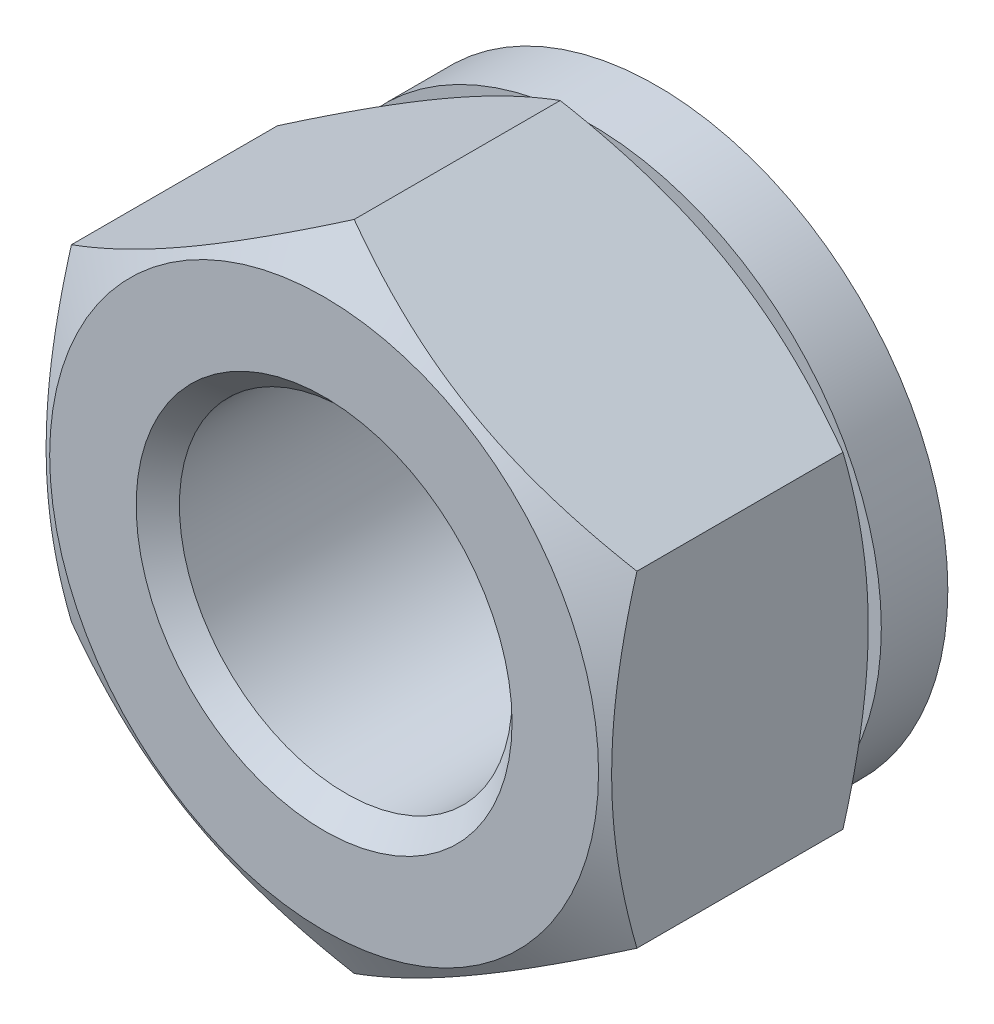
ISO-10303-21;
HEADER;
FILE_DESCRIPTION(('STEP AP214'),'2;1');
FILE_NAME('part.step','',(''),(''),'','','');
FILE_SCHEMA(('AUTOMOTIVE_DESIGN { 1 0 10303 214 1 1 1 1 }'));
ENDSEC;
DATA;
#1=APPLICATION_CONTEXT('core data for automotive mechanical design processes');
#2=APPLICATION_PROTOCOL_DEFINITION('international standard','automotive_design',2000,#1);
#3=PRODUCT_CONTEXT('',#1,'mechanical');
#4=PRODUCT('Part','Part','',(#3));
#5=PRODUCT_RELATED_PRODUCT_CATEGORY('part','',(#4));
#6=PRODUCT_DEFINITION_FORMATION('','',#4);
#7=PRODUCT_DEFINITION_CONTEXT('part definition',#1,'design');
#8=PRODUCT_DEFINITION('design','',#6,#7);
#9=PRODUCT_DEFINITION_SHAPE('','',#8);
#10=(LENGTH_UNIT() NAMED_UNIT(*) SI_UNIT(.MILLI.,.METRE.));
#11=(NAMED_UNIT(*) PLANE_ANGLE_UNIT() SI_UNIT($,.RADIAN.));
#12=(NAMED_UNIT(*) SI_UNIT($,.STERADIAN.) SOLID_ANGLE_UNIT());
#13=UNCERTAINTY_MEASURE_WITH_UNIT(LENGTH_MEASURE(1.E-05),#10,'distance_accuracy_value','');
#14=(GEOMETRIC_REPRESENTATION_CONTEXT(3) GLOBAL_UNCERTAINTY_ASSIGNED_CONTEXT((#13)) GLOBAL_UNIT_ASSIGNED_CONTEXT((#10,
#11,#12)) REPRESENTATION_CONTEXT('',''));
#15=CARTESIAN_POINT('',(0.,0.,0.));
#16=DIRECTION('',(0.,0.,1.));
#17=DIRECTION('',(1.,0.,0.));
#18=AXIS2_PLACEMENT_3D('',#15,#16,#17);
#19=CARTESIAN_POINT('',(0.,0.,2.));
#20=DIRECTION('',(0.,0.,-1.));
#21=DIRECTION('',(-1.,0.,0.));
#22=AXIS2_PLACEMENT_3D('',#19,#20,#21);
#23=CYLINDRICAL_SURFACE('',#22,8.75);
#24=CARTESIAN_POINT('',(0.,0.,2.));
#25=DIRECTION('',(0.,0.,1.));
#26=DIRECTION('',(1.,0.,0.));
#27=AXIS2_PLACEMENT_3D('',#24,#25,#26);
#28=CIRCLE('',#27,8.75);
#29=CARTESIAN_POINT('',(8.75,0.,2.));
#30=VERTEX_POINT('',#29);
#31=EDGE_CURVE('E108',#30,#30,#28,.T.);
#32=ORIENTED_EDGE('',*,*,#31,.F.);
#33=EDGE_LOOP('',(#32));
#34=FACE_BOUND('',#33,.T.);
#35=CARTESIAN_POINT('',(0.,0.,0.));
#36=DIRECTION('',(0.,0.,1.));
#37=DIRECTION('',(1.,0.,0.));
#38=AXIS2_PLACEMENT_3D('',#35,#36,#37);
#39=CIRCLE('',#38,8.75);
#40=CARTESIAN_POINT('',(8.75,0.,0.));
#41=VERTEX_POINT('',#40);
#42=EDGE_CURVE('E105',#41,#41,#39,.T.);
#43=ORIENTED_EDGE('',*,*,#42,.T.);
#44=EDGE_LOOP('',(#43));
#45=FACE_BOUND('',#44,.T.);
#46=ADVANCED_FACE('F14',(#34,#45),#23,.T.);
#47=CARTESIAN_POINT('',(0.,0.,2.));
#48=DIRECTION('',(0.,0.,1.));
#49=DIRECTION('',(1.,0.,0.));
#50=AXIS2_PLACEMENT_3D('',#47,#48,#49);
#51=PLANE('',#50);
#52=ORIENTED_EDGE('',*,*,#31,.T.);
#53=EDGE_LOOP('',(#52));
#54=FACE_BOUND('',#53,.T.);
#55=CARTESIAN_POINT('',(0.,0.,2.));
#56=DIRECTION('',(0.,0.,-1.));
#57=DIRECTION('',(-1.,0.,0.));
#58=AXIS2_PLACEMENT_3D('',#55,#56,#57);
#59=CIRCLE('',#58,8.25);
#60=CARTESIAN_POINT('',(-8.25,0.,2.));
#61=VERTEX_POINT('',#60);
#62=EDGE_CURVE('E85',#61,#61,#59,.T.);
#63=ORIENTED_EDGE('',*,*,#62,.T.);
#64=EDGE_LOOP('',(#63));
#65=FACE_BOUND('',#64,.T.);
#66=ADVANCED_FACE('F238',(#54,#65),#51,.T.);
#67=CARTESIAN_POINT('',(0.,0.,0.));
#68=DIRECTION('',(0.,0.,1.));
#69=DIRECTION('',(1.,0.,0.));
#70=AXIS2_PLACEMENT_3D('',#67,#68,#69);
#71=PLANE('',#70);
#72=CARTESIAN_POINT('',(0.,0.,0.));
#73=DIRECTION('',(0.,0.,1.));
#74=DIRECTION('',(1.,0.,0.));
#75=AXIS2_PLACEMENT_3D('',#72,#73,#74);
#76=CIRCLE('',#75,5.);
#77=CARTESIAN_POINT('',(5.,0.,0.));
#78=VERTEX_POINT('',#77);
#79=EDGE_CURVE('E93',#78,#78,#76,.T.);
#80=ORIENTED_EDGE('',*,*,#79,.T.);
#81=EDGE_LOOP('',(#80));
#82=FACE_BOUND('',#81,.T.);
#83=ORIENTED_EDGE('',*,*,#42,.F.);
#84=EDGE_LOOP('',(#83));
#85=FACE_BOUND('',#84,.T.);
#86=ADVANCED_FACE('F231',(#82,#85),#71,.F.);
#87=CARTESIAN_POINT('',(8.50003933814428,4.9075,10.));
#88=DIRECTION('',(-0.5,-0.866025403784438,0.));
#89=DIRECTION('',(0.866025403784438,-0.5,0.));
#90=AXIS2_PLACEMENT_3D('',#87,#88,#89);
#91=PLANE('',#90);
#92=DIRECTION('',(0.,0.,-1.));
#93=VECTOR('',#92,1.);
#94=CARTESIAN_POINT('',(8.50003933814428,4.9075,10.));
#95=LINE('',#94,#93);
#96=CARTESIAN_POINT('',(8.50003933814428,4.9075,9.09644682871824));
#97=VERTEX_POINT('',#96);
#98=CARTESIAN_POINT('',(8.50003933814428,4.9075,2.90355317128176));
#99=VERTEX_POINT('',#98);
#100=EDGE_CURVE('E89',#97,#99,#95,.T.);
#101=ORIENTED_EDGE('',*,*,#100,.T.);
#102=CARTESIAN_POINT('',(8.50023933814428,4.90738452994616,2.90361983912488));
#103=CARTESIAN_POINT('',(8.31339924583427,5.01525670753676,2.84134964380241));
#104=CARTESIAN_POINT('',(8.12586254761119,5.12353107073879,2.78190552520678));
#105=CARTESIAN_POINT('',(7.7492661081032,5.34095912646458,2.66944781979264));
#106=CARTESIAN_POINT('',(7.56020574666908,5.45011317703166,2.61643700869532));
#107=CARTESIAN_POINT('',(6.98999759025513,5.77932300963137,2.46809516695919));
#108=CARTESIAN_POINT('',(6.60659893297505,6.00067832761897,2.38372031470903));
#109=CARTESIAN_POINT('',(6.03285025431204,6.33193228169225,2.28478094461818));
#110=CARTESIAN_POINT('',(5.84421428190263,6.44084131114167,2.25659599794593));
#111=CARTESIAN_POINT('',(5.46608927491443,6.65915188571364,2.20933466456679));
#112=CARTESIAN_POINT('',(5.27660031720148,6.76855338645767,2.19025747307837));
#113=CARTESIAN_POINT('',(4.89729613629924,6.98754475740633,2.16169513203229));
#114=CARTESIAN_POINT('',(4.70748152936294,7.09713427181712,2.15219909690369));
#115=CARTESIAN_POINT('',(4.32767697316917,7.31641453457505,2.14300265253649));
#116=CARTESIAN_POINT('',(4.13768702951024,7.42610527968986,2.14330194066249));
#117=CARTESIAN_POINT('',(3.7824944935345,7.63117578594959,2.15301479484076));
#118=CARTESIAN_POINT('',(3.61726683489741,7.72657001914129,2.16124352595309));
#119=CARTESIAN_POINT('',(3.28719849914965,7.91713506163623,2.18494970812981));
#120=CARTESIAN_POINT('',(3.12235784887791,8.01230585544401,2.20042764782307));
#121=CARTESIAN_POINT('',(2.62847406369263,8.29744979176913,2.25736942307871));
#122=CARTESIAN_POINT('',(2.30030514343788,8.48691820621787,2.3093341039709));
#123=CARTESIAN_POINT('',(1.6404861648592,8.86786487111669,2.43924658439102));
#124=CARTESIAN_POINT('',(1.30892031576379,9.05929450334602,2.5177450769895));
#125=CARTESIAN_POINT('',(0.650733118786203,9.43929905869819,2.69590417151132));
#126=CARTESIAN_POINT('',(0.324103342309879,9.62787884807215,2.79552292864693));
#127=CARTESIAN_POINT('',(-0.000199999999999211,9.81511547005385,2.90361983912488));
#128=B_SPLINE_CURVE_WITH_KNOTS('',3,(#102,#103,#104,#105,#106,#107,#108,#109,#110,#111,#112,
#113,#114,#115,#116,#117,#118,#119,#120,#121,#122,#123,#124,#125,#126,#127),.UNSPECIFIED.,.F.,
.F.,(4,2,2,2,2,2,2,2,2,2,2,2,4),(0.,0.673599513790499,1.34748863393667,2.69806680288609,
3.35681548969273,4.01550595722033,4.67344721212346,5.33136813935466,5.90412289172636,
6.47691625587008,7.62331889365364,8.79514640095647,9.96467355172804),.UNSPECIFIED.);
#129=CARTESIAN_POINT('',(0.,9.815,2.90355317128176));
#130=VERTEX_POINT('',#129);
#131=EDGE_CURVE('E35',#99,#130,#128,.T.);
#132=ORIENTED_EDGE('',*,*,#131,.T.);
#133=DIRECTION('',(0.,0.,-1.));
#134=VECTOR('',#133,1.);
#135=CARTESIAN_POINT('',(0.,9.815,10.));
#136=LINE('',#135,#134);
#137=CARTESIAN_POINT('',(0.,9.815,9.09644682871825));
#138=VERTEX_POINT('',#137);
#139=EDGE_CURVE('E102',#138,#130,#136,.T.);
#140=ORIENTED_EDGE('',*,*,#139,.F.);
#141=CARTESIAN_POINT('',(-0.000199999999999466,9.81511547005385,9.09638016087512));
#142=CARTESIAN_POINT('',(0.186640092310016,9.70724329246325,9.15865035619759));
#143=CARTESIAN_POINT('',(0.374176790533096,9.59896892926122,9.21809447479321));
#144=CARTESIAN_POINT('',(0.750773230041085,9.38154087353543,9.33055218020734));
#145=CARTESIAN_POINT('',(0.939833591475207,9.27238682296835,9.38356299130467));
#146=CARTESIAN_POINT('',(1.51004174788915,8.94317699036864,9.5319048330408));
#147=CARTESIAN_POINT('',(1.89344040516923,8.72182167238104,9.61627968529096));
#148=CARTESIAN_POINT('',(2.46718908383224,8.39056771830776,9.7152190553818));
#149=CARTESIAN_POINT('',(2.65582505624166,8.28165868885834,9.74340400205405));
#150=CARTESIAN_POINT('',(3.03395006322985,8.06334811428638,9.7906653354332));
#151=CARTESIAN_POINT('',(3.2234390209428,7.95394661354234,9.80974252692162));
#152=CARTESIAN_POINT('',(3.60274320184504,7.73495524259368,9.8383048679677));
#153=CARTESIAN_POINT('',(3.79255780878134,7.62536572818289,9.84780090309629));
#154=CARTESIAN_POINT('',(4.17236236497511,7.40608546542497,9.8569973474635));
#155=CARTESIAN_POINT('',(4.36235230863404,7.29639472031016,9.85669805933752));
#156=CARTESIAN_POINT('',(4.71754484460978,7.09132421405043,9.84698520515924));
#157=CARTESIAN_POINT('',(4.88277250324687,6.99592998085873,9.83875647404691));
#158=CARTESIAN_POINT('',(5.21284083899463,6.80536493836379,9.81505029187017));
#159=CARTESIAN_POINT('',(5.37768148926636,6.71019414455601,9.79957235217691));
#160=CARTESIAN_POINT('',(5.87156527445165,6.42505020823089,9.74263057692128));
#161=CARTESIAN_POINT('',(6.1997341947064,6.23558179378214,9.69066589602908));
#162=CARTESIAN_POINT('',(6.85955317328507,5.85463512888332,9.56075341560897));
#163=CARTESIAN_POINT('',(7.19111902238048,5.663205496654,9.48225492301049));
#164=CARTESIAN_POINT('',(7.84930621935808,5.28320094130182,9.30409582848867));
#165=CARTESIAN_POINT('',(8.1759359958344,5.09462115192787,9.20447707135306));
#166=CARTESIAN_POINT('',(8.50023933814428,4.90738452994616,9.09638016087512));
#167=B_SPLINE_CURVE_WITH_KNOTS('',3,(#141,#142,#143,#144,#145,#146,#147,#148,#149,#150,#151,
#152,#153,#154,#155,#156,#157,#158,#159,#160,#161,#162,#163,#164,#165,#166),.UNSPECIFIED.,.F.,
.F.,(4,2,2,2,2,2,2,2,2,2,2,2,4),(0.,0.673599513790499,1.34748863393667,2.69806680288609,
3.35681548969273,4.01550595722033,4.67344721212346,5.33136813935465,5.90412289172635,
6.47691625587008,7.62331889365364,8.79514640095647,9.96467355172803),.UNSPECIFIED.);
#168=EDGE_CURVE('E130',#138,#97,#167,.T.);
#169=ORIENTED_EDGE('',*,*,#168,.T.);
#170=EDGE_LOOP('',(#101,#132,#140,#169));
#171=FACE_BOUND('',#170,.T.);
#172=ADVANCED_FACE('F147',(#171),#91,.F.);
#173=CARTESIAN_POINT('',(0.,9.815,10.));
#174=DIRECTION('',(0.5,-0.866025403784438,0.));
#175=DIRECTION('',(0.866025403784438,0.5,0.));
#176=AXIS2_PLACEMENT_3D('',#173,#174,#175);
#177=PLANE('',#176);
#178=ORIENTED_EDGE('',*,*,#139,.T.);
#179=CARTESIAN_POINT('',(0.000200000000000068,9.81511547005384,2.90361983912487));
#180=CARTESIAN_POINT('',(-0.186640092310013,9.70724329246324,2.8413496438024));
#181=CARTESIAN_POINT('',(-0.374176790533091,9.59896892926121,2.78190552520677));
#182=CARTESIAN_POINT('',(-0.750773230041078,9.38154087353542,2.66944781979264));
#183=CARTESIAN_POINT('',(-0.9398335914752,9.27238682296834,2.61643700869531));
#184=CARTESIAN_POINT('',(-1.51004174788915,8.94317699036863,2.46809516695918));
#185=CARTESIAN_POINT('',(-1.89344040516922,8.72182167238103,2.38372031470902));
#186=CARTESIAN_POINT('',(-2.46718908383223,8.39056771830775,2.28478094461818));
#187=CARTESIAN_POINT('',(-2.65582505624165,8.28165868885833,2.25659599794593));
#188=CARTESIAN_POINT('',(-3.03395006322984,8.06334811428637,2.20933466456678));
#189=CARTESIAN_POINT('',(-3.22343902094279,7.95394661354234,2.19025747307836));
#190=CARTESIAN_POINT('',(-3.60274320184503,7.73495524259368,2.16169513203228));
#191=CARTESIAN_POINT('',(-3.79255780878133,7.62536572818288,2.15219909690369));
#192=CARTESIAN_POINT('',(-4.1723623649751,7.40608546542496,2.14300265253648));
#193=CARTESIAN_POINT('',(-4.36235230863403,7.29639472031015,2.14330194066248));
#194=CARTESIAN_POINT('',(-4.71754484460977,7.09132421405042,2.15301479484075));
#195=CARTESIAN_POINT('',(-4.88277250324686,6.99592998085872,2.16124352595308));
#196=CARTESIAN_POINT('',(-5.21284083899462,6.80536493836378,2.18494970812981));
#197=CARTESIAN_POINT('',(-5.37768148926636,6.710194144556,2.20042764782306));
#198=CARTESIAN_POINT('',(-5.87156527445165,6.42505020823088,2.2573694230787));
#199=CARTESIAN_POINT('',(-6.19973419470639,6.23558179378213,2.3093341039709));
#200=CARTESIAN_POINT('',(-6.85955317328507,5.85463512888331,2.43924658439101));
#201=CARTESIAN_POINT('',(-7.19111902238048,5.66320549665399,2.51774507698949));
#202=CARTESIAN_POINT('',(-7.84930621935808,5.28320094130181,2.69590417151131));
#203=CARTESIAN_POINT('',(-8.1759359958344,5.09462115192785,2.79552292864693));
#204=CARTESIAN_POINT('',(-8.50023933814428,4.90738452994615,2.90361983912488));
#205=B_SPLINE_CURVE_WITH_KNOTS('',3,(#179,#180,#181,#182,#183,#184,#185,#186,#187,#188,#189,
#190,#191,#192,#193,#194,#195,#196,#197,#198,#199,#200,#201,#202,#203,#204),.UNSPECIFIED.,.F.,
.F.,(4,2,2,2,2,2,2,2,2,2,2,2,4),(0.,0.673599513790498,1.34748863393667,2.69806680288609,
3.35681548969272,4.01550595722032,4.67344721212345,5.33136813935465,5.90412289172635,
6.47691625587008,7.62331889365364,8.79514640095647,9.96467355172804),.UNSPECIFIED.);
#206=CARTESIAN_POINT('',(-8.50003933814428,4.9075,2.90355317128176));
#207=VERTEX_POINT('',#206);
#208=EDGE_CURVE('E204',#130,#207,#205,.T.);
#209=ORIENTED_EDGE('',*,*,#208,.T.);
#210=DIRECTION('',(0.,0.,-1.));
#211=VECTOR('',#210,1.);
#212=CARTESIAN_POINT('',(-8.50003933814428,4.9075,10.));
#213=LINE('',#212,#211);
#214=CARTESIAN_POINT('',(-8.50003933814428,4.9075,9.09644682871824));
#215=VERTEX_POINT('',#214);
#216=EDGE_CURVE('E99',#215,#207,#213,.T.);
#217=ORIENTED_EDGE('',*,*,#216,.F.);
#218=CARTESIAN_POINT('',(-8.50023933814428,4.90738452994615,9.09638016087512));
#219=CARTESIAN_POINT('',(-8.31339924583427,5.01525670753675,9.15865035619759));
#220=CARTESIAN_POINT('',(-8.12586254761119,5.12353107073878,9.21809447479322));
#221=CARTESIAN_POINT('',(-7.7492661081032,5.34095912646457,9.33055218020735));
#222=CARTESIAN_POINT('',(-7.56020574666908,5.45011317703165,9.38356299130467));
#223=CARTESIAN_POINT('',(-6.98999759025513,5.77932300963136,9.53190483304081));
#224=CARTESIAN_POINT('',(-6.60659893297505,6.00067832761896,9.61627968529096));
#225=CARTESIAN_POINT('',(-6.03285025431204,6.33193228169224,9.71521905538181));
#226=CARTESIAN_POINT('',(-5.84421428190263,6.44084131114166,9.74340400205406));
#227=CARTESIAN_POINT('',(-5.46608927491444,6.65915188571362,9.7906653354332));
#228=CARTESIAN_POINT('',(-5.27660031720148,6.76855338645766,9.80974252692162));
#229=CARTESIAN_POINT('',(-4.89729613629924,6.98754475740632,9.8383048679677));
#230=CARTESIAN_POINT('',(-4.70748152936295,7.09713427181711,9.8478009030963));
#231=CARTESIAN_POINT('',(-4.32767697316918,7.31641453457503,9.85699734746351));
#232=CARTESIAN_POINT('',(-4.13768702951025,7.42610527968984,9.85669805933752));
#233=CARTESIAN_POINT('',(-3.78249449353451,7.63117578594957,9.84698520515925));
#234=CARTESIAN_POINT('',(-3.61726683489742,7.72657001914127,9.83875647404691));
#235=CARTESIAN_POINT('',(-3.28719849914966,7.91713506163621,9.81505029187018));
#236=CARTESIAN_POINT('',(-3.12235784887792,8.01230585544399,9.79957235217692));
#237=CARTESIAN_POINT('',(-2.62847406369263,8.29744979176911,9.74263057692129));
#238=CARTESIAN_POINT('',(-2.30030514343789,8.48691820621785,9.69066589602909));
#239=CARTESIAN_POINT('',(-1.64048616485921,8.86786487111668,9.56075341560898));
#240=CARTESIAN_POINT('',(-1.3089203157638,9.059294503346,9.4822549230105));
#241=CARTESIAN_POINT('',(-0.650733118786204,9.43929905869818,9.30409582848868));
#242=CARTESIAN_POINT('',(-0.324103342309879,9.62787884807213,9.20447707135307));
#243=CARTESIAN_POINT('',(0.000199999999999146,9.81511547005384,9.09638016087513));
#244=B_SPLINE_CURVE_WITH_KNOTS('',3,(#218,#219,#220,#221,#222,#223,#224,#225,#226,#227,#228,
#229,#230,#231,#232,#233,#234,#235,#236,#237,#238,#239,#240,#241,#242,#243),.UNSPECIFIED.,.F.,
.F.,(4,2,2,2,2,2,2,2,2,2,2,2,4),(0.,0.673599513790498,1.34748863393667,2.69806680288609,
3.35681548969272,4.01550595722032,4.67344721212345,5.33136813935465,5.90412289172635,
6.47691625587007,7.62331889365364,8.79514640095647,9.96467355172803),.UNSPECIFIED.);
#245=EDGE_CURVE('E132',#215,#138,#244,.T.);
#246=ORIENTED_EDGE('',*,*,#245,.T.);
#247=EDGE_LOOP('',(#178,#209,#217,#246));
#248=FACE_BOUND('',#247,.T.);
#249=ADVANCED_FACE('F189',(#248),#177,.F.);
#250=CARTESIAN_POINT('',(-8.50003933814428,4.9075,10.));
#251=DIRECTION('',(1.,0.,0.));
#252=DIRECTION('',(0.,1.,0.));
#253=AXIS2_PLACEMENT_3D('',#250,#251,#252);
#254=PLANE('',#253);
#255=ORIENTED_EDGE('',*,*,#216,.T.);
#256=CARTESIAN_POINT('',(-8.50003933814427,-13.1271960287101,6.26596035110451));
#257=CARTESIAN_POINT('',(-8.50003933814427,-12.7564005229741,6.08631294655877));
#258=CARTESIAN_POINT('',(-8.50003933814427,-12.3847479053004,5.90840405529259));
#259=CARTESIAN_POINT('',(-8.50003933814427,-11.639272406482,5.55704220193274));
#260=CARTESIAN_POINT('',(-8.50003933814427,-11.2654491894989,5.38358995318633));
#261=CARTESIAN_POINT('',(-8.50003933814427,-10.5132239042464,5.04123586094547));
#262=CARTESIAN_POINT('',(-8.50003933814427,-10.1348079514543,4.87236441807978));
#263=CARTESIAN_POINT('',(-8.50003933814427,-9.37494700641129,4.5416061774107));
#264=CARTESIAN_POINT('',(-8.50003933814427,-8.99350215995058,4.37971904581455));
#265=CARTESIAN_POINT('',(-8.50003933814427,-8.21487833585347,4.05980450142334));
#266=CARTESIAN_POINT('',(-8.50003933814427,-7.8175825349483,3.90205983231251));
#267=CARTESIAN_POINT('',(-8.50003933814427,-7.01832355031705,3.59864278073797));
#268=CARTESIAN_POINT('',(-8.50003933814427,-6.6163598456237,3.45297176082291));
#269=CARTESIAN_POINT('',(-8.50003933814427,-5.8078909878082,3.17756695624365));
#270=CARTESIAN_POINT('',(-8.50003933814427,-5.40139711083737,3.04780042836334));
#271=CARTESIAN_POINT('',(-8.50003933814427,-4.5825936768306,2.80840297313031));
#272=CARTESIAN_POINT('',(-8.50003933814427,-4.17028601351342,2.69876564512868));
#273=CARTESIAN_POINT('',(-8.50003933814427,-3.34182963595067,2.50551172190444));
#274=CARTESIAN_POINT('',(-8.50003933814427,-2.92571425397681,2.42175611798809));
#275=CARTESIAN_POINT('',(-8.50003933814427,-2.29779625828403,2.31918745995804));
#276=CARTESIAN_POINT('',(-8.50003933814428,-2.08785026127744,2.28884062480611));
#277=CARTESIAN_POINT('',(-8.50003933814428,-1.666933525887,2.23643165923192));
#278=CARTESIAN_POINT('',(-8.50003933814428,-1.45596288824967,2.21436873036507));
#279=CARTESIAN_POINT('',(-8.50003933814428,-1.03601130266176,2.17924099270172));
#280=CARTESIAN_POINT('',(-8.50003933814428,-0.827039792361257,2.16606378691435));
#281=CARTESIAN_POINT('',(-8.50003933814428,-0.408727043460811,2.14855433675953));
#282=CARTESIAN_POINT('',(-8.50003933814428,-0.199385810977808,2.14422194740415));
#283=CARTESIAN_POINT('',(-8.50003933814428,0.219292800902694,2.14450534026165));
#284=CARTESIAN_POINT('',(-8.50003933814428,0.428630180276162,2.14912116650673));
#285=CARTESIAN_POINT('',(-8.50003933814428,0.846925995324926,2.16718913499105));
#286=CARTESIAN_POINT('',(-8.50003933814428,1.05588441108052,2.18064172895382));
#287=CARTESIAN_POINT('',(-8.50003933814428,1.55975494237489,2.22345224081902));
#288=CARTESIAN_POINT('',(-8.50003933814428,1.85431041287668,2.25709613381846));
#289=CARTESIAN_POINT('',(-8.50003933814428,2.44118501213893,2.34009477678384));
#290=CARTESIAN_POINT('',(-8.50003933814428,2.73350382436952,2.38945170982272));
#291=CARTESIAN_POINT('',(-8.50003933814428,3.60679938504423,2.55847056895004));
#292=CARTESIAN_POINT('',(-8.50003933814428,4.18377882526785,2.69904823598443));
#293=CARTESIAN_POINT('',(-8.50003933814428,5.04644135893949,2.94219009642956));
#294=CARTESIAN_POINT('',(-8.50003933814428,5.33661493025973,3.02973307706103));
#295=CARTESIAN_POINT('',(-8.50003933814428,5.91414265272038,3.21375413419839));
#296=CARTESIAN_POINT('',(-8.50003933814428,6.20149678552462,3.31023226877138));
#297=CARTESIAN_POINT('',(-8.50003933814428,6.77347904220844,3.51058879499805));
#298=CARTESIAN_POINT('',(-8.50003933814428,7.05810806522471,3.61446464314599));
#299=CARTESIAN_POINT('',(-8.50003933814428,7.62501855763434,3.82841012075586));
#300=CARTESIAN_POINT('',(-8.50003933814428,7.90730005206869,3.93847968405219));
#301=CARTESIAN_POINT('',(-8.50003933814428,8.56328889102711,4.20123752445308));
#302=CARTESIAN_POINT('',(-8.50003933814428,8.93619219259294,4.35592918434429));
#303=CARTESIAN_POINT('',(-8.50003933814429,9.67891328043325,4.67257096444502));
#304=CARTESIAN_POINT('',(-8.50003933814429,10.0487308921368,4.83452149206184));
#305=CARTESIAN_POINT('',(-8.50003933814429,10.7858420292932,5.16425519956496));
#306=CARTESIAN_POINT('',(-8.50003933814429,11.1531350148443,5.33203958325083));
#307=CARTESIAN_POINT('',(-8.50003933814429,11.8855331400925,5.67228799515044));
#308=CARTESIAN_POINT('',(-8.50003933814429,12.2506383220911,5.84475193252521));
#309=CARTESIAN_POINT('',(-8.50003933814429,12.9793935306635,6.1936792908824));
#310=CARTESIAN_POINT('',(-8.50003933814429,13.3430416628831,6.37014666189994));
#311=CARTESIAN_POINT('',(-8.50003933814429,14.0687892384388,6.72624062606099));
#312=CARTESIAN_POINT('',(-8.50003933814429,14.430888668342,6.90586724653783));
#313=CARTESIAN_POINT('',(-8.50003933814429,15.5151373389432,7.44861552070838));
#314=CARTESIAN_POINT('',(-8.50003933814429,16.2353279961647,7.81564952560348));
#315=CARTESIAN_POINT('',(-8.50003933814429,17.6133335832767,8.5268751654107));
#316=CARTESIAN_POINT('',(-8.50003933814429,18.271447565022,8.87048992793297));
#317=CARTESIAN_POINT('',(-8.50003933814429,19.5852195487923,9.562431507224));
#318=CARTESIAN_POINT('',(-8.50003933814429,20.2408774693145,9.91075847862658));
#319=CARTESIAN_POINT('',(-8.50003933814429,21.5487128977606,10.6101790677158));
#320=CARTESIAN_POINT('',(-8.5000393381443,22.2008949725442,10.9612641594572));
#321=CARTESIAN_POINT('',(-8.5000393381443,23.5036827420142,11.6662666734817));
#322=CARTESIAN_POINT('',(-8.5000393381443,24.154288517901,12.0201839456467));
#323=CARTESIAN_POINT('',(-8.5000393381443,24.8043111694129,12.3751618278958));
#324=B_SPLINE_CURVE_WITH_KNOTS('',3,(#256,#257,#258,#259,#260,#261,#262,#263,#264,#265,#266,
#267,#268,#269,#270,#271,#272,#273,#274,#275,#276,#277,#278,#279,#280,#281,#282,#283,#284,#285,
#286,#287,#288,#289,#290,#291,#292,#293,#294,#295,#296,#297,#298,#299,#300,#301,#302,#303,#304,
#305,#306,#307,#308,#309,#310,#311,#312,#313,#314,#315,#316,#317,#318,#319,#320,#321,#322,#323),
.UNSPECIFIED.,.F.,.F.,(4,2,2,2,2,2,2,2,2,2,2,2,2,2,2,2,2,2,2,2,2,2,2,2,2,2,2,2,2,2,2,2,2,4),(0.,
1.23608270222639,2.47236203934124,3.71546510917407,4.95850870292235,6.24075501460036,
7.52314583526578,8.80285054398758,10.0821476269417,11.35444923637,11.990695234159,
12.6268798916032,13.2548583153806,13.8828264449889,14.5107976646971,15.1388009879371,
16.0277094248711,16.9167414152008,18.6958148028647,19.6050155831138,20.5142222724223,
21.4231178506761,22.3320037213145,23.5430484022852,24.7541611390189,25.9655252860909,
27.1768659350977,28.3894587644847,29.6020620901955,32.0269655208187,34.2542003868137,
36.4815085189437,38.7035316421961,40.9254377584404),.UNSPECIFIED.);
#325=CARTESIAN_POINT('',(-8.50003933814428,-4.9075,2.90355317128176));
#326=VERTEX_POINT('',#325);
#327=EDGE_CURVE('E196',#207,#326,#324,.F.);
#328=ORIENTED_EDGE('',*,*,#327,.T.);
#329=DIRECTION('',(0.,0.,-1.));
#330=VECTOR('',#329,1.);
#331=CARTESIAN_POINT('',(-8.50003933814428,-4.9075,10.));
#332=LINE('',#331,#330);
#333=CARTESIAN_POINT('',(-8.50003933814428,-4.9075,9.09644682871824));
#334=VERTEX_POINT('',#333);
#335=EDGE_CURVE('E91',#334,#326,#332,.T.);
#336=ORIENTED_EDGE('',*,*,#335,.F.);
#337=CARTESIAN_POINT('',(-8.50003933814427,-13.1271960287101,5.73403964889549));
#338=CARTESIAN_POINT('',(-8.50003933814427,-12.7564005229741,5.91368705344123));
#339=CARTESIAN_POINT('',(-8.50003933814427,-12.3847479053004,6.0915959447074));
#340=CARTESIAN_POINT('',(-8.50003933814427,-11.639272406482,6.44295779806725));
#341=CARTESIAN_POINT('',(-8.50003933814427,-11.2654491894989,6.61641004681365));
#342=CARTESIAN_POINT('',(-8.50003933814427,-10.5132239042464,6.95876413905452));
#343=CARTESIAN_POINT('',(-8.50003933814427,-10.1348079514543,7.12763558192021));
#344=CARTESIAN_POINT('',(-8.50003933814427,-9.37494700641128,7.45839382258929));
#345=CARTESIAN_POINT('',(-8.50003933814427,-8.99350215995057,7.62028095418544));
#346=CARTESIAN_POINT('',(-8.50003933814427,-8.21487833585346,7.94019549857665));
#347=CARTESIAN_POINT('',(-8.50003933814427,-7.8175825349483,8.09794016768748));
#348=CARTESIAN_POINT('',(-8.50003933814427,-7.01832355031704,8.40135721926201));
#349=CARTESIAN_POINT('',(-8.50003933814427,-6.61635984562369,8.54702823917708));
#350=CARTESIAN_POINT('',(-8.50003933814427,-5.8078909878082,8.82243304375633));
#351=CARTESIAN_POINT('',(-8.50003933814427,-5.40139711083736,8.95219957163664));
#352=CARTESIAN_POINT('',(-8.50003933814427,-4.58259367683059,9.19159702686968));
#353=CARTESIAN_POINT('',(-8.50003933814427,-4.17028601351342,9.30123435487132));
#354=CARTESIAN_POINT('',(-8.50003933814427,-3.34182963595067,9.49448827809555));
#355=CARTESIAN_POINT('',(-8.50003933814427,-2.92571425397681,9.57824388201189));
#356=CARTESIAN_POINT('',(-8.50003933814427,-2.29779625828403,9.68081254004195));
#357=CARTESIAN_POINT('',(-8.50003933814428,-2.08785026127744,9.71115937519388));
#358=CARTESIAN_POINT('',(-8.50003933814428,-1.666933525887,9.76356834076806));
#359=CARTESIAN_POINT('',(-8.50003933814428,-1.45596288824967,9.78563126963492));
#360=CARTESIAN_POINT('',(-8.50003933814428,-1.03601130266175,9.82075900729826));
#361=CARTESIAN_POINT('',(-8.50003933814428,-0.827039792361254,9.83393621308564));
#362=CARTESIAN_POINT('',(-8.50003933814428,-0.408727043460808,9.85144566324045));
#363=CARTESIAN_POINT('',(-8.50003933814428,-0.199385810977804,9.85577805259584));
#364=CARTESIAN_POINT('',(-8.50003933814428,0.219292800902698,9.85549465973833));
#365=CARTESIAN_POINT('',(-8.50003933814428,0.428630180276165,9.85087883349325));
#366=CARTESIAN_POINT('',(-8.50003933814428,0.84692599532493,9.83281086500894));
#367=CARTESIAN_POINT('',(-8.50003933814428,1.05588441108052,9.81935827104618));
#368=CARTESIAN_POINT('',(-8.50003933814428,1.5597549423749,9.77654775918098));
#369=CARTESIAN_POINT('',(-8.50003933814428,1.85431041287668,9.74290386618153));
#370=CARTESIAN_POINT('',(-8.50003933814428,2.44118501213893,9.65990522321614));
#371=CARTESIAN_POINT('',(-8.50003933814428,2.73350382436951,9.61054829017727));
#372=CARTESIAN_POINT('',(-8.50003933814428,3.60679938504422,9.44152943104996));
#373=CARTESIAN_POINT('',(-8.50003933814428,4.18377882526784,9.30095176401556));
#374=CARTESIAN_POINT('',(-8.50003933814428,5.04644135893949,9.05780990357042));
#375=CARTESIAN_POINT('',(-8.50003933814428,5.33661493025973,8.97026692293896));
#376=CARTESIAN_POINT('',(-8.50003933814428,5.91414265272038,8.7862458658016));
#377=CARTESIAN_POINT('',(-8.50003933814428,6.20149678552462,8.6897677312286));
#378=CARTESIAN_POINT('',(-8.50003933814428,6.77347904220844,8.48941120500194));
#379=CARTESIAN_POINT('',(-8.50003933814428,7.0581080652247,8.38553535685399));
#380=CARTESIAN_POINT('',(-8.50003933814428,7.62501855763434,8.17158987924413));
#381=CARTESIAN_POINT('',(-8.50003933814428,7.90730005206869,8.06152031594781));
#382=CARTESIAN_POINT('',(-8.50003933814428,8.5632888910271,7.79876247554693));
#383=CARTESIAN_POINT('',(-8.50003933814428,8.93619219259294,7.6440708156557));
#384=CARTESIAN_POINT('',(-8.50003933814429,9.67891328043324,7.32742903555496));
#385=CARTESIAN_POINT('',(-8.50003933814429,10.0487308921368,7.16547850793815));
#386=CARTESIAN_POINT('',(-8.50003933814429,10.7858420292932,6.83574480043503));
#387=CARTESIAN_POINT('',(-8.50003933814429,11.1531350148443,6.66796041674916));
#388=CARTESIAN_POINT('',(-8.50003933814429,11.8855331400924,6.32771200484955));
#389=CARTESIAN_POINT('',(-8.50003933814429,12.2506383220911,6.15524806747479));
#390=CARTESIAN_POINT('',(-8.50003933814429,12.9793935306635,5.8063207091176));
#391=CARTESIAN_POINT('',(-8.50003933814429,13.3430416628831,5.62985333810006));
#392=CARTESIAN_POINT('',(-8.50003933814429,14.0687892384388,5.27375937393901));
#393=CARTESIAN_POINT('',(-8.50003933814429,14.430888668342,5.09413275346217));
#394=CARTESIAN_POINT('',(-8.50003933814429,15.5151373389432,4.55138447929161));
#395=CARTESIAN_POINT('',(-8.50003933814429,16.2353279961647,4.18435047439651));
#396=CARTESIAN_POINT('',(-8.50003933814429,17.6133335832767,3.4731248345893));
#397=CARTESIAN_POINT('',(-8.50003933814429,18.271447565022,3.12951007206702));
#398=CARTESIAN_POINT('',(-8.50003933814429,19.5852195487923,2.43756849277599));
#399=CARTESIAN_POINT('',(-8.50003933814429,20.2408774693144,2.08924152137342));
#400=CARTESIAN_POINT('',(-8.50003933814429,21.5487128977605,1.38982093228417));
#401=CARTESIAN_POINT('',(-8.5000393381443,22.2008949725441,1.03873584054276));
#402=CARTESIAN_POINT('',(-8.5000393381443,23.5036827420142,0.33373332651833));
#403=CARTESIAN_POINT('',(-8.5000393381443,24.154288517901,-0.0201839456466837));
#404=CARTESIAN_POINT('',(-8.5000393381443,24.8043111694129,-0.37516182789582));
#405=B_SPLINE_CURVE_WITH_KNOTS('',3,(#337,#338,#339,#340,#341,#342,#343,#344,#345,#346,#347,
#348,#349,#350,#351,#352,#353,#354,#355,#356,#357,#358,#359,#360,#361,#362,#363,#364,#365,#366,
#367,#368,#369,#370,#371,#372,#373,#374,#375,#376,#377,#378,#379,#380,#381,#382,#383,#384,#385,
#386,#387,#388,#389,#390,#391,#392,#393,#394,#395,#396,#397,#398,#399,#400,#401,#402,#403,#404),
.UNSPECIFIED.,.F.,.F.,(4,2,2,2,2,2,2,2,2,2,2,2,2,2,2,2,2,2,2,2,2,2,2,2,2,2,2,2,2,2,2,2,2,4),(0.,
1.23608270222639,2.47236203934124,3.71546510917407,4.95850870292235,6.24075501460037,
7.52314583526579,8.80285054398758,10.0821476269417,11.35444923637,11.990695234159,
12.6268798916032,13.2548583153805,13.8828264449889,14.5107976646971,15.1388009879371,
16.0277094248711,16.9167414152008,18.6958148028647,19.6050155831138,20.5142222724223,
21.423117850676,22.3320037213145,23.5430484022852,24.7541611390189,25.9655252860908,
27.1768659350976,28.3894587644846,29.6020620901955,32.0269655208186,34.2542003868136,
36.4815085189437,38.7035316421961,40.9254377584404),.UNSPECIFIED.);
#406=EDGE_CURVE('E178',#334,#215,#405,.T.);
#407=ORIENTED_EDGE('',*,*,#406,.T.);
#408=EDGE_LOOP('',(#255,#328,#336,#407));
#409=FACE_BOUND('',#408,.T.);
#410=ADVANCED_FACE('F185',(#409),#254,.F.);
#411=CARTESIAN_POINT('',(-8.50003933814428,-4.9075,10.));
#412=DIRECTION('',(0.5,0.866025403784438,0.));
#413=DIRECTION('',(-0.866025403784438,0.5,0.));
#414=AXIS2_PLACEMENT_3D('',#411,#412,#413);
#415=PLANE('',#414);
#416=ORIENTED_EDGE('',*,*,#335,.T.);
#417=CARTESIAN_POINT('',(-8.50023933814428,-4.90738452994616,2.90361983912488));
#418=CARTESIAN_POINT('',(-8.31339924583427,-5.01525670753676,2.84134964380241));
#419=CARTESIAN_POINT('',(-8.12586254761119,-5.12353107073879,2.78190552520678));
#420=CARTESIAN_POINT('',(-7.7492661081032,-5.34095912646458,2.66944781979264));
#421=CARTESIAN_POINT('',(-7.56020574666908,-5.45011317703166,2.61643700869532));
#422=CARTESIAN_POINT('',(-6.98999759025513,-5.77932300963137,2.46809516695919));
#423=CARTESIAN_POINT('',(-6.60659893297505,-6.00067832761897,2.38372031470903));
#424=CARTESIAN_POINT('',(-6.03285025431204,-6.33193228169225,2.28478094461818));
#425=CARTESIAN_POINT('',(-5.84421428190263,-6.44084131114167,2.25659599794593));
#426=CARTESIAN_POINT('',(-5.46608927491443,-6.65915188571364,2.20933466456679));
#427=CARTESIAN_POINT('',(-5.27660031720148,-6.76855338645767,2.19025747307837));
#428=CARTESIAN_POINT('',(-4.89729613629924,-6.98754475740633,2.16169513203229));
#429=CARTESIAN_POINT('',(-4.70748152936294,-7.09713427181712,2.15219909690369));
#430=CARTESIAN_POINT('',(-4.32767697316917,-7.31641453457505,2.14300265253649));
#431=CARTESIAN_POINT('',(-4.13768702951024,-7.42610527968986,2.14330194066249));
#432=CARTESIAN_POINT('',(-3.7824944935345,-7.63117578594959,2.15301479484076));
#433=CARTESIAN_POINT('',(-3.61726683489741,-7.72657001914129,2.16124352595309));
#434=CARTESIAN_POINT('',(-3.28719849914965,-7.91713506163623,2.18494970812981));
#435=CARTESIAN_POINT('',(-3.12235784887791,-8.01230585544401,2.20042764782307));
#436=CARTESIAN_POINT('',(-2.62847406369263,-8.29744979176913,2.25736942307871));
#437=CARTESIAN_POINT('',(-2.30030514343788,-8.48691820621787,2.3093341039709));
#438=CARTESIAN_POINT('',(-1.6404861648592,-8.86786487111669,2.43924658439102));
#439=CARTESIAN_POINT('',(-1.30892031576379,-9.05929450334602,2.5177450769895));
#440=CARTESIAN_POINT('',(-0.650733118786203,-9.43929905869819,2.69590417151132));
#441=CARTESIAN_POINT('',(-0.324103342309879,-9.62787884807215,2.79552292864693));
#442=CARTESIAN_POINT('',(0.000199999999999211,-9.81511547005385,2.90361983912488));
#443=B_SPLINE_CURVE_WITH_KNOTS('',3,(#417,#418,#419,#420,#421,#422,#423,#424,#425,#426,#427,
#428,#429,#430,#431,#432,#433,#434,#435,#436,#437,#438,#439,#440,#441,#442),.UNSPECIFIED.,.F.,
.F.,(4,2,2,2,2,2,2,2,2,2,2,2,4),(0.,0.673599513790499,1.34748863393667,2.69806680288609,
3.35681548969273,4.01550595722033,4.67344721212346,5.33136813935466,5.90412289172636,
6.47691625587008,7.62331889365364,8.79514640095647,9.96467355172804),.UNSPECIFIED.);
#444=CARTESIAN_POINT('',(0.,-9.815,2.90355317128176));
#445=VERTEX_POINT('',#444);
#446=EDGE_CURVE('E84',#326,#445,#443,.T.);
#447=ORIENTED_EDGE('',*,*,#446,.T.);
#448=DIRECTION('',(0.,0.,-1.));
#449=VECTOR('',#448,1.);
#450=CARTESIAN_POINT('',(0.,-9.815,10.));
#451=LINE('',#450,#449);
#452=CARTESIAN_POINT('',(0.,-9.815,9.09644682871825));
#453=VERTEX_POINT('',#452);
#454=EDGE_CURVE('E83',#453,#445,#451,.T.);
#455=ORIENTED_EDGE('',*,*,#454,.F.);
#456=CARTESIAN_POINT('',(0.000199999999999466,-9.81511547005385,9.09638016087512));
#457=CARTESIAN_POINT('',(-0.186640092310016,-9.70724329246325,9.15865035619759));
#458=CARTESIAN_POINT('',(-0.374176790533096,-9.59896892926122,9.21809447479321));
#459=CARTESIAN_POINT('',(-0.750773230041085,-9.38154087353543,9.33055218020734));
#460=CARTESIAN_POINT('',(-0.939833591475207,-9.27238682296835,9.38356299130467));
#461=CARTESIAN_POINT('',(-1.51004174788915,-8.94317699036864,9.5319048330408));
#462=CARTESIAN_POINT('',(-1.89344040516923,-8.72182167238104,9.61627968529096));
#463=CARTESIAN_POINT('',(-2.46718908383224,-8.39056771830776,9.7152190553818));
#464=CARTESIAN_POINT('',(-2.65582505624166,-8.28165868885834,9.74340400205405));
#465=CARTESIAN_POINT('',(-3.03395006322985,-8.06334811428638,9.7906653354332));
#466=CARTESIAN_POINT('',(-3.2234390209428,-7.95394661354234,9.80974252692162));
#467=CARTESIAN_POINT('',(-3.60274320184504,-7.73495524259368,9.8383048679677));
#468=CARTESIAN_POINT('',(-3.79255780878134,-7.62536572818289,9.84780090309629));
#469=CARTESIAN_POINT('',(-4.17236236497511,-7.40608546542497,9.8569973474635));
#470=CARTESIAN_POINT('',(-4.36235230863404,-7.29639472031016,9.85669805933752));
#471=CARTESIAN_POINT('',(-4.71754484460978,-7.09132421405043,9.84698520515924));
#472=CARTESIAN_POINT('',(-4.88277250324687,-6.99592998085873,9.83875647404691));
#473=CARTESIAN_POINT('',(-5.21284083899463,-6.80536493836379,9.81505029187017));
#474=CARTESIAN_POINT('',(-5.37768148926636,-6.71019414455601,9.79957235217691));
#475=CARTESIAN_POINT('',(-5.87156527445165,-6.42505020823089,9.74263057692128));
#476=CARTESIAN_POINT('',(-6.1997341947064,-6.23558179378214,9.69066589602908));
#477=CARTESIAN_POINT('',(-6.85955317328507,-5.85463512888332,9.56075341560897));
#478=CARTESIAN_POINT('',(-7.19111902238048,-5.663205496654,9.48225492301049));
#479=CARTESIAN_POINT('',(-7.84930621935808,-5.28320094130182,9.30409582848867));
#480=CARTESIAN_POINT('',(-8.1759359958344,-5.09462115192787,9.20447707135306));
#481=CARTESIAN_POINT('',(-8.50023933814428,-4.90738452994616,9.09638016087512));
#482=B_SPLINE_CURVE_WITH_KNOTS('',3,(#456,#457,#458,#459,#460,#461,#462,#463,#464,#465,#466,
#467,#468,#469,#470,#471,#472,#473,#474,#475,#476,#477,#478,#479,#480,#481),.UNSPECIFIED.,.F.,
.F.,(4,2,2,2,2,2,2,2,2,2,2,2,4),(0.,0.673599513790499,1.34748863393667,2.69806680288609,
3.35681548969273,4.01550595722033,4.67344721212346,5.33136813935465,5.90412289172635,
6.47691625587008,7.62331889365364,8.79514640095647,9.96467355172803),.UNSPECIFIED.);
#483=EDGE_CURVE('E172',#453,#334,#482,.T.);
#484=ORIENTED_EDGE('',*,*,#483,.T.);
#485=EDGE_LOOP('',(#416,#447,#455,#484));
#486=FACE_BOUND('',#485,.T.);
#487=ADVANCED_FACE('F188',(#486),#415,.F.);
#488=CARTESIAN_POINT('',(0.,-9.815,10.));
#489=DIRECTION('',(-0.5,0.866025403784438,0.));
#490=DIRECTION('',(-0.866025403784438,-0.5,0.));
#491=AXIS2_PLACEMENT_3D('',#488,#489,#490);
#492=PLANE('',#491);
#493=ORIENTED_EDGE('',*,*,#454,.T.);
#494=CARTESIAN_POINT('',(-0.000200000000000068,-9.81511547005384,2.90361983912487));
#495=CARTESIAN_POINT('',(0.186640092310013,-9.70724329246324,2.8413496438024));
#496=CARTESIAN_POINT('',(0.374176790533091,-9.59896892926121,2.78190552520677));
#497=CARTESIAN_POINT('',(0.750773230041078,-9.38154087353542,2.66944781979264));
#498=CARTESIAN_POINT('',(0.9398335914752,-9.27238682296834,2.61643700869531));
#499=CARTESIAN_POINT('',(1.51004174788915,-8.94317699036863,2.46809516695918));
#500=CARTESIAN_POINT('',(1.89344040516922,-8.72182167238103,2.38372031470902));
#501=CARTESIAN_POINT('',(2.46718908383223,-8.39056771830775,2.28478094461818));
#502=CARTESIAN_POINT('',(2.65582505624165,-8.28165868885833,2.25659599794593));
#503=CARTESIAN_POINT('',(3.03395006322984,-8.06334811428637,2.20933466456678));
#504=CARTESIAN_POINT('',(3.22343902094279,-7.95394661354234,2.19025747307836));
#505=CARTESIAN_POINT('',(3.60274320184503,-7.73495524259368,2.16169513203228));
#506=CARTESIAN_POINT('',(3.79255780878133,-7.62536572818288,2.15219909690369));
#507=CARTESIAN_POINT('',(4.1723623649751,-7.40608546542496,2.14300265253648));
#508=CARTESIAN_POINT('',(4.36235230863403,-7.29639472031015,2.14330194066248));
#509=CARTESIAN_POINT('',(4.71754484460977,-7.09132421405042,2.15301479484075));
#510=CARTESIAN_POINT('',(4.88277250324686,-6.99592998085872,2.16124352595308));
#511=CARTESIAN_POINT('',(5.21284083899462,-6.80536493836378,2.18494970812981));
#512=CARTESIAN_POINT('',(5.37768148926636,-6.710194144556,2.20042764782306));
#513=CARTESIAN_POINT('',(5.87156527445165,-6.42505020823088,2.2573694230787));
#514=CARTESIAN_POINT('',(6.19973419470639,-6.23558179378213,2.3093341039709));
#515=CARTESIAN_POINT('',(6.85955317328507,-5.85463512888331,2.43924658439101));
#516=CARTESIAN_POINT('',(7.19111902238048,-5.66320549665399,2.51774507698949));
#517=CARTESIAN_POINT('',(7.84930621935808,-5.28320094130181,2.69590417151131));
#518=CARTESIAN_POINT('',(8.1759359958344,-5.09462115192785,2.79552292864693));
#519=CARTESIAN_POINT('',(8.50023933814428,-4.90738452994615,2.90361983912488));
#520=B_SPLINE_CURVE_WITH_KNOTS('',3,(#494,#495,#496,#497,#498,#499,#500,#501,#502,#503,#504,
#505,#506,#507,#508,#509,#510,#511,#512,#513,#514,#515,#516,#517,#518,#519),.UNSPECIFIED.,.F.,
.F.,(4,2,2,2,2,2,2,2,2,2,2,2,4),(0.,0.673599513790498,1.34748863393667,2.69806680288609,
3.35681548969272,4.01550595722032,4.67344721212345,5.33136813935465,5.90412289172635,
6.47691625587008,7.62331889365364,8.79514640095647,9.96467355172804),.UNSPECIFIED.);
#521=CARTESIAN_POINT('',(8.50003933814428,-4.9075,2.90355317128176));
#522=VERTEX_POINT('',#521);
#523=EDGE_CURVE('E71',#445,#522,#520,.T.);
#524=ORIENTED_EDGE('',*,*,#523,.T.);
#525=DIRECTION('',(0.,0.,-1.));
#526=VECTOR('',#525,1.);
#527=CARTESIAN_POINT('',(8.50003933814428,-4.9075,10.));
#528=LINE('',#527,#526);
#529=CARTESIAN_POINT('',(8.50003933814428,-4.9075,9.09644682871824));
#530=VERTEX_POINT('',#529);
#531=EDGE_CURVE('E81',#530,#522,#528,.T.);
#532=ORIENTED_EDGE('',*,*,#531,.F.);
#533=CARTESIAN_POINT('',(8.50023933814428,-4.90738452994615,9.09638016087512));
#534=CARTESIAN_POINT('',(8.31339924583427,-5.01525670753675,9.15865035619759));
#535=CARTESIAN_POINT('',(8.12586254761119,-5.12353107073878,9.21809447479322));
#536=CARTESIAN_POINT('',(7.7492661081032,-5.34095912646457,9.33055218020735));
#537=CARTESIAN_POINT('',(7.56020574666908,-5.45011317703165,9.38356299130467));
#538=CARTESIAN_POINT('',(6.98999759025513,-5.77932300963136,9.53190483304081));
#539=CARTESIAN_POINT('',(6.60659893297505,-6.00067832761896,9.61627968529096));
#540=CARTESIAN_POINT('',(6.03285025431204,-6.33193228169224,9.71521905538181));
#541=CARTESIAN_POINT('',(5.84421428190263,-6.44084131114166,9.74340400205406));
#542=CARTESIAN_POINT('',(5.46608927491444,-6.65915188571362,9.7906653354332));
#543=CARTESIAN_POINT('',(5.27660031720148,-6.76855338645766,9.80974252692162));
#544=CARTESIAN_POINT('',(4.89729613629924,-6.98754475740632,9.8383048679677));
#545=CARTESIAN_POINT('',(4.70748152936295,-7.09713427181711,9.8478009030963));
#546=CARTESIAN_POINT('',(4.32767697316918,-7.31641453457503,9.85699734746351));
#547=CARTESIAN_POINT('',(4.13768702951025,-7.42610527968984,9.85669805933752));
#548=CARTESIAN_POINT('',(3.78249449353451,-7.63117578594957,9.84698520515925));
#549=CARTESIAN_POINT('',(3.61726683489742,-7.72657001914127,9.83875647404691));
#550=CARTESIAN_POINT('',(3.28719849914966,-7.91713506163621,9.81505029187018));
#551=CARTESIAN_POINT('',(3.12235784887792,-8.01230585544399,9.79957235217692));
#552=CARTESIAN_POINT('',(2.62847406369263,-8.29744979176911,9.74263057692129));
#553=CARTESIAN_POINT('',(2.30030514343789,-8.48691820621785,9.69066589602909));
#554=CARTESIAN_POINT('',(1.64048616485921,-8.86786487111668,9.56075341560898));
#555=CARTESIAN_POINT('',(1.3089203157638,-9.059294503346,9.4822549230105));
#556=CARTESIAN_POINT('',(0.650733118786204,-9.43929905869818,9.30409582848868));
#557=CARTESIAN_POINT('',(0.324103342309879,-9.62787884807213,9.20447707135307));
#558=CARTESIAN_POINT('',(-0.000199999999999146,-9.81511547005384,9.09638016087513));
#559=B_SPLINE_CURVE_WITH_KNOTS('',3,(#533,#534,#535,#536,#537,#538,#539,#540,#541,#542,#543,
#544,#545,#546,#547,#548,#549,#550,#551,#552,#553,#554,#555,#556,#557,#558),.UNSPECIFIED.,.F.,
.F.,(4,2,2,2,2,2,2,2,2,2,2,2,4),(0.,0.673599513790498,1.34748863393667,2.69806680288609,
3.35681548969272,4.01550595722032,4.67344721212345,5.33136813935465,5.90412289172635,
6.47691625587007,7.62331889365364,8.79514640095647,9.96467355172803),.UNSPECIFIED.);
#560=EDGE_CURVE('E42',#530,#453,#559,.T.);
#561=ORIENTED_EDGE('',*,*,#560,.T.);
#562=EDGE_LOOP('',(#493,#524,#532,#561));
#563=FACE_BOUND('',#562,.T.);
#564=ADVANCED_FACE('F80',(#563),#492,.F.);
#565=CARTESIAN_POINT('',(8.50003933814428,-4.9075,10.));
#566=DIRECTION('',(-1.,0.,0.));
#567=DIRECTION('',(0.,0.,1.));
#568=AXIS2_PLACEMENT_3D('',#565,#566,#567);
#569=PLANE('',#568);
#570=ORIENTED_EDGE('',*,*,#531,.T.);
#571=CARTESIAN_POINT('',(8.50003933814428,-13.1271960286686,6.26596035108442));
#572=CARTESIAN_POINT('',(8.50003933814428,-12.756400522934,6.08631294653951));
#573=CARTESIAN_POINT('',(8.50003933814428,-12.3847479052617,5.90840405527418));
#574=CARTESIAN_POINT('',(8.50003933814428,-11.6392724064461,5.55704220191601));
#575=CARTESIAN_POINT('',(8.50003933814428,-11.2654491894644,5.38358995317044));
#576=CARTESIAN_POINT('',(8.50003933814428,-10.5132239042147,5.04123586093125));
#577=CARTESIAN_POINT('',(8.50003933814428,-10.134807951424,4.8723644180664));
#578=CARTESIAN_POINT('',(8.50003933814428,-9.37494700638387,4.54160617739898));
#579=CARTESIAN_POINT('',(8.50003933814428,-8.9935021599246,4.37971904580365));
#580=CARTESIAN_POINT('',(8.50003933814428,-8.21487833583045,4.05980450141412));
#581=CARTESIAN_POINT('',(8.50003933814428,-7.81758253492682,3.90205983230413));
#582=CARTESIAN_POINT('',(8.50003933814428,-7.01832355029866,3.59864278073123));
#583=CARTESIAN_POINT('',(8.50003933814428,-6.61635984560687,3.45297176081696));
#584=CARTESIAN_POINT('',(8.50003933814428,-5.80789098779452,3.17756695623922));
#585=CARTESIAN_POINT('',(8.50003933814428,-5.40139711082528,3.04780042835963));
#586=CARTESIAN_POINT('',(8.50003933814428,-4.58259367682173,2.80840297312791));
#587=CARTESIAN_POINT('',(8.50003933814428,-4.17028601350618,2.69876564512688));
#588=CARTESIAN_POINT('',(8.50003933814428,-3.34182963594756,2.50551172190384));
#589=CARTESIAN_POINT('',(8.50003933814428,-2.9257142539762,2.42175611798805));
#590=CARTESIAN_POINT('',(8.50003933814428,-2.29779625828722,2.31918745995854));
#591=CARTESIAN_POINT('',(8.50003933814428,-2.0878502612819,2.28884062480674));
#592=CARTESIAN_POINT('',(8.50003933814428,-1.66693352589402,2.23643165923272));
#593=CARTESIAN_POINT('',(8.50003933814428,-1.45596288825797,2.2143687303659));
#594=CARTESIAN_POINT('',(8.50003933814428,-1.03601130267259,2.1792409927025));
#595=CARTESIAN_POINT('',(8.50003933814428,-0.827039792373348,2.16606378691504));
#596=CARTESIAN_POINT('',(8.50003933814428,-0.408727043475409,2.14855433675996));
#597=CARTESIAN_POINT('',(8.50003933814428,-0.199385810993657,2.14422194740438));
#598=CARTESIAN_POINT('',(8.50003933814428,0.21929280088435,2.1445053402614));
#599=CARTESIAN_POINT('',(8.50003933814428,0.428630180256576,2.14912116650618));
#600=CARTESIAN_POINT('',(8.50003933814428,0.846925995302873,2.1671891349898));
#601=CARTESIAN_POINT('',(8.50003933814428,1.05588441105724,2.18064172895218));
#602=CARTESIAN_POINT('',(8.50003933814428,1.55975494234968,2.22345224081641));
#603=CARTESIAN_POINT('',(8.50003933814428,1.85431041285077,2.25709613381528));
#604=CARTESIAN_POINT('',(8.50003933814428,2.44118501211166,2.3400947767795));
#605=CARTESIAN_POINT('',(8.50003933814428,2.73350382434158,2.38945170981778));
#606=CARTESIAN_POINT('',(8.50003933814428,3.60679938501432,2.5584705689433));
#607=CARTESIAN_POINT('',(8.50003933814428,4.18377882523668,2.69904823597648));
#608=CARTESIAN_POINT('',(8.50003933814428,5.04644135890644,2.94219009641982));
#609=CARTESIAN_POINT('',(8.50003933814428,5.33661493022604,3.02973307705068));
#610=CARTESIAN_POINT('',(8.50003933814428,5.91414265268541,3.21375413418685));
#611=CARTESIAN_POINT('',(8.50003933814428,6.20149678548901,3.31023226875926));
#612=CARTESIAN_POINT('',(8.50003933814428,6.77347904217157,3.51058879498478));
#613=CARTESIAN_POINT('',(8.50003933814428,7.0581080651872,3.61446464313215));
#614=CARTESIAN_POINT('',(8.50003933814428,7.62501855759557,3.82841012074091));
#615=CARTESIAN_POINT('',(8.50003933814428,7.90730005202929,3.93847968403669));
#616=CARTESIAN_POINT('',(8.50003933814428,8.56328889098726,4.20123752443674));
#617=CARTESIAN_POINT('',(8.50003933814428,8.93619219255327,4.35592918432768));
#618=CARTESIAN_POINT('',(8.50003933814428,9.67891328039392,4.67257096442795));
#619=CARTESIAN_POINT('',(8.50003933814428,10.0487308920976,4.83452149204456));
#620=CARTESIAN_POINT('',(8.50003933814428,10.7858420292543,5.16425519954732));
#621=CARTESIAN_POINT('',(8.50003933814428,11.1531350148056,5.33203958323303));
#622=CARTESIAN_POINT('',(8.50003933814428,11.885533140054,5.67228799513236));
#623=CARTESIAN_POINT('',(8.50003933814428,12.2506383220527,5.844751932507));
#624=CARTESIAN_POINT('',(8.50003933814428,12.9793935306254,6.19367929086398));
#625=CARTESIAN_POINT('',(8.50003933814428,13.3430416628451,6.37014666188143));
#626=CARTESIAN_POINT('',(8.50003933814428,14.068789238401,6.72624062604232));
#627=CARTESIAN_POINT('',(8.50003933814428,14.4308886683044,6.90586724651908));
#628=CARTESIAN_POINT('',(8.50003933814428,15.5151373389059,7.44861552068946));
#629=CARTESIAN_POINT('',(8.50003933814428,16.2353279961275,7.81564952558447));
#630=CARTESIAN_POINT('',(8.50003933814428,17.6133335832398,8.52687516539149));
#631=CARTESIAN_POINT('',(8.50003933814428,18.2714475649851,8.87048992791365));
#632=CARTESIAN_POINT('',(8.50003933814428,19.5852195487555,9.56243150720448));
#633=CARTESIAN_POINT('',(8.50003933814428,20.2408774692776,9.91075847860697));
#634=CARTESIAN_POINT('',(8.50003933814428,21.5487128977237,10.610179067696));
#635=CARTESIAN_POINT('',(8.50003933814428,22.2008949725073,10.9612641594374));
#636=CARTESIAN_POINT('',(8.50003933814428,23.5036827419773,11.6662666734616));
#637=CARTESIAN_POINT('',(8.50003933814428,24.1542885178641,12.0201839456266));
#638=CARTESIAN_POINT('',(8.50003933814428,24.8043111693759,12.3751618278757));
#639=B_SPLINE_CURVE_WITH_KNOTS('',3,(#571,#572,#573,#574,#575,#576,#577,#578,#579,#580,#581,
#582,#583,#584,#585,#586,#587,#588,#589,#590,#591,#592,#593,#594,#595,#596,#597,#598,#599,#600,
#601,#602,#603,#604,#605,#606,#607,#608,#609,#610,#611,#612,#613,#614,#615,#616,#617,#618,#619,
#620,#621,#622,#623,#624,#625,#626,#627,#628,#629,#630,#631,#632,#633,#634,#635,#636,#637,#638),
.UNSPECIFIED.,.F.,.F.,(4,2,2,2,2,2,2,2,2,2,2,2,2,2,2,2,2,2,2,2,2,2,2,2,2,2,2,2,2,2,2,2,2,4),(0.,
1.23608270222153,2.47236203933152,3.71546510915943,4.9585087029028,6.2407550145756,
7.5231458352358,8.8028505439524,10.0821476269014,11.3544492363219,11.9906952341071,
12.6268798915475,13.2548583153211,13.8828264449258,14.5107976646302,15.1388009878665,
16.0277094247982,16.9167414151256,18.6958148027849,19.6050155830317,20.5142222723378,
21.4231178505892,22.3320037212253,23.5430484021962,24.7541611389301,25.9655252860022,
27.1768659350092,28.3894587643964,29.6020620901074,32.026965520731,34.2542003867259,
36.4815085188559,38.7035316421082,40.9254377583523),.UNSPECIFIED.);
#640=EDGE_CURVE('E9',#522,#99,#639,.T.);
#641=ORIENTED_EDGE('',*,*,#640,.T.);
#642=ORIENTED_EDGE('',*,*,#100,.F.);
#643=CARTESIAN_POINT('',(8.50003933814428,-13.1271960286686,5.73403964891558));
#644=CARTESIAN_POINT('',(8.50003933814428,-12.756400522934,5.91368705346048));
#645=CARTESIAN_POINT('',(8.50003933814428,-12.3847479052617,6.09159594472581));
#646=CARTESIAN_POINT('',(8.50003933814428,-11.6392724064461,6.44295779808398));
#647=CARTESIAN_POINT('',(8.50003933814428,-11.2654491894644,6.61641004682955));
#648=CARTESIAN_POINT('',(8.50003933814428,-10.5132239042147,6.95876413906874));
#649=CARTESIAN_POINT('',(8.50003933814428,-10.134807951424,7.12763558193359));
#650=CARTESIAN_POINT('',(8.50003933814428,-9.37494700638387,7.45839382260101));
#651=CARTESIAN_POINT('',(8.50003933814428,-8.99350215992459,7.62028095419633));
#652=CARTESIAN_POINT('',(8.50003933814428,-8.21487833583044,7.94019549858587));
#653=CARTESIAN_POINT('',(8.50003933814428,-7.81758253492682,8.09794016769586));
#654=CARTESIAN_POINT('',(8.50003933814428,-7.01832355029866,8.40135721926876));
#655=CARTESIAN_POINT('',(8.50003933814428,-6.61635984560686,8.54702823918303));
#656=CARTESIAN_POINT('',(8.50003933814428,-5.80789098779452,8.82243304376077));
#657=CARTESIAN_POINT('',(8.50003933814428,-5.40139711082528,8.95219957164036));
#658=CARTESIAN_POINT('',(8.50003933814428,-4.58259367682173,9.19159702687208));
#659=CARTESIAN_POINT('',(8.50003933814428,-4.17028601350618,9.30123435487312));
#660=CARTESIAN_POINT('',(8.50003933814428,-3.34182963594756,9.49448827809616));
#661=CARTESIAN_POINT('',(8.50003933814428,-2.9257142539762,9.57824388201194));
#662=CARTESIAN_POINT('',(8.50003933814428,-2.29779625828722,9.68081254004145));
#663=CARTESIAN_POINT('',(8.50003933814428,-2.0878502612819,9.71115937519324));
#664=CARTESIAN_POINT('',(8.50003933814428,-1.66693352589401,9.76356834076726));
#665=CARTESIAN_POINT('',(8.50003933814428,-1.45596288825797,9.78563126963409));
#666=CARTESIAN_POINT('',(8.50003933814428,-1.03601130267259,9.82075900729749));
#667=CARTESIAN_POINT('',(8.50003933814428,-0.827039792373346,9.83393621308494));
#668=CARTESIAN_POINT('',(8.50003933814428,-0.408727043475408,9.85144566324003));
#669=CARTESIAN_POINT('',(8.50003933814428,-0.199385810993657,9.85577805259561));
#670=CARTESIAN_POINT('',(8.50003933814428,0.21929280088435,9.85549465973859));
#671=CARTESIAN_POINT('',(8.50003933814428,0.428630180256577,9.8508788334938));
#672=CARTESIAN_POINT('',(8.50003933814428,0.846925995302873,9.83281086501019));
#673=CARTESIAN_POINT('',(8.50003933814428,1.05588441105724,9.81935827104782));
#674=CARTESIAN_POINT('',(8.50003933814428,1.55975494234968,9.7765477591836));
#675=CARTESIAN_POINT('',(8.50003933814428,1.85431041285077,9.74290386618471));
#676=CARTESIAN_POINT('',(8.50003933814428,2.44118501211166,9.65990522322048));
#677=CARTESIAN_POINT('',(8.50003933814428,2.73350382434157,9.61054829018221));
#678=CARTESIAN_POINT('',(8.50003933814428,3.60679938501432,9.44152943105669));
#679=CARTESIAN_POINT('',(8.50003933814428,4.18377882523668,9.30095176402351));
#680=CARTESIAN_POINT('',(8.50003933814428,5.04644135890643,9.05780990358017));
#681=CARTESIAN_POINT('',(8.50003933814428,5.33661493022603,8.97026692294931));
#682=CARTESIAN_POINT('',(8.50003933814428,5.91414265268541,8.78624586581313));
#683=CARTESIAN_POINT('',(8.50003933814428,6.20149678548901,8.68976773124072));
#684=CARTESIAN_POINT('',(8.50003933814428,6.77347904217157,8.48941120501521));
#685=CARTESIAN_POINT('',(8.50003933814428,7.0581080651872,8.38553535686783));
#686=CARTESIAN_POINT('',(8.50003933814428,7.62501855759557,8.17158987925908));
#687=CARTESIAN_POINT('',(8.50003933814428,7.90730005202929,8.06152031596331));
#688=CARTESIAN_POINT('',(8.50003933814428,8.56328889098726,7.79876247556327));
#689=CARTESIAN_POINT('',(8.50003933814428,8.93619219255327,7.64407081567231));
#690=CARTESIAN_POINT('',(8.50003933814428,9.67891328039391,7.32742903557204));
#691=CARTESIAN_POINT('',(8.50003933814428,10.0487308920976,7.16547850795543));
#692=CARTESIAN_POINT('',(8.50003933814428,10.7858420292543,6.83574480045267));
#693=CARTESIAN_POINT('',(8.50003933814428,11.1531350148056,6.66796041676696));
#694=CARTESIAN_POINT('',(8.50003933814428,11.885533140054,6.32771200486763));
#695=CARTESIAN_POINT('',(8.50003933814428,12.2506383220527,6.15524806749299));
#696=CARTESIAN_POINT('',(8.50003933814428,12.9793935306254,5.80632070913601));
#697=CARTESIAN_POINT('',(8.50003933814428,13.3430416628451,5.62985333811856));
#698=CARTESIAN_POINT('',(8.50003933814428,14.068789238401,5.27375937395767));
#699=CARTESIAN_POINT('',(8.50003933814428,14.4308886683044,5.09413275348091));
#700=CARTESIAN_POINT('',(8.50003933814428,15.5151373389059,4.55138447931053));
#701=CARTESIAN_POINT('',(8.50003933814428,16.2353279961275,4.18435047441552));
#702=CARTESIAN_POINT('',(8.50003933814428,17.6133335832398,3.4731248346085));
#703=CARTESIAN_POINT('',(8.50003933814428,18.2714475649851,3.12951007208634));
#704=CARTESIAN_POINT('',(8.50003933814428,19.5852195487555,2.43756849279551));
#705=CARTESIAN_POINT('',(8.50003933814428,20.2408774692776,2.08924152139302));
#706=CARTESIAN_POINT('',(8.50003933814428,21.5487128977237,1.38982093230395));
#707=CARTESIAN_POINT('',(8.50003933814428,22.2008949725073,1.03873584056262));
#708=CARTESIAN_POINT('',(8.50003933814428,23.5036827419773,0.33373332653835));
#709=CARTESIAN_POINT('',(8.50003933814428,24.1542885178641,-0.0201839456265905));
#710=CARTESIAN_POINT('',(8.50003933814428,24.8043111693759,-0.375161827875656));
#711=B_SPLINE_CURVE_WITH_KNOTS('',3,(#643,#644,#645,#646,#647,#648,#649,#650,#651,#652,#653,
#654,#655,#656,#657,#658,#659,#660,#661,#662,#663,#664,#665,#666,#667,#668,#669,#670,#671,#672,
#673,#674,#675,#676,#677,#678,#679,#680,#681,#682,#683,#684,#685,#686,#687,#688,#689,#690,#691,
#692,#693,#694,#695,#696,#697,#698,#699,#700,#701,#702,#703,#704,#705,#706,#707,#708,#709,#710),
.UNSPECIFIED.,.F.,.F.,(4,2,2,2,2,2,2,2,2,2,2,2,2,2,2,2,2,2,2,2,2,2,2,2,2,2,2,2,2,2,2,2,2,4),(0.,
1.23608270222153,2.47236203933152,3.71546510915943,4.95850870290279,6.2407550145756,
7.5231458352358,8.8028505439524,10.0821476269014,11.3544492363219,11.9906952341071,
12.6268798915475,13.2548583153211,13.8828264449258,14.5107976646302,15.1388009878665,
16.0277094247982,16.9167414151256,18.6958148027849,19.6050155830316,20.5142222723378,
21.4231178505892,22.3320037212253,23.5430484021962,24.75416113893,25.9655252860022,
27.1768659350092,28.3894587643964,29.6020620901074,32.026965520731,34.2542003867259,
36.4815085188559,38.7035316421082,40.9254377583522),.UNSPECIFIED.);
#712=EDGE_CURVE('E88',#97,#530,#711,.F.);
#713=ORIENTED_EDGE('',*,*,#712,.T.);
#714=EDGE_LOOP('',(#570,#641,#642,#713));
#715=FACE_BOUND('',#714,.T.);
#716=ADVANCED_FACE('F87',(#715),#569,.F.);
#717=CARTESIAN_POINT('',(0.,9.815,10.));
#718=DIRECTION('',(0.,0.,1.));
#719=DIRECTION('',(1.,0.,0.));
#720=AXIS2_PLACEMENT_3D('',#717,#718,#719);
#721=PLANE('',#720);
#722=CARTESIAN_POINT('',(0.,0.,10.));
#723=DIRECTION('',(0.,0.,-1.));
#724=DIRECTION('',(-1.,0.,0.));
#725=AXIS2_PLACEMENT_3D('',#722,#723,#724);
#726=CIRCLE('',#725,8.25);
#727=CARTESIAN_POINT('',(-8.25,0.,10.));
#728=VERTEX_POINT('',#727);
#729=EDGE_CURVE('E219',#728,#728,#726,.T.);
#730=ORIENTED_EDGE('',*,*,#729,.F.);
#731=EDGE_LOOP('',(#730));
#732=FACE_BOUND('',#731,.T.);
#733=CARTESIAN_POINT('',(0.,0.,10.));
#734=DIRECTION('',(0.,0.,1.));
#735=DIRECTION('',(1.,0.,0.));
#736=AXIS2_PLACEMENT_3D('',#733,#734,#735);
#737=CIRCLE('',#736,5.65);
#738=CARTESIAN_POINT('',(5.65,0.,10.));
#739=VERTEX_POINT('',#738);
#740=EDGE_CURVE('E28',#739,#739,#737,.F.);
#741=ORIENTED_EDGE('',*,*,#740,.T.);
#742=EDGE_LOOP('',(#741));
#743=FACE_BOUND('',#742,.T.);
#744=ADVANCED_FACE('F116',(#732,#743),#721,.T.);
#745=CARTESIAN_POINT('',(0.,0.,0.));
#746=DIRECTION('',(0.,0.,1.));
#747=DIRECTION('',(1.,0.,0.));
#748=AXIS2_PLACEMENT_3D('',#745,#746,#747);
#749=CYLINDRICAL_SURFACE('',#748,5.);
#750=CARTESIAN_POINT('',(0.,0.,9.35));
#751=DIRECTION('',(0.,0.,1.));
#752=DIRECTION('',(1.,0.,0.));
#753=AXIS2_PLACEMENT_3D('',#750,#751,#752);
#754=CIRCLE('',#753,5.);
#755=CARTESIAN_POINT('',(5.,0.,9.35));
#756=VERTEX_POINT('',#755);
#757=EDGE_CURVE('E111',#756,#756,#754,.T.);
#758=ORIENTED_EDGE('',*,*,#757,.T.);
#759=EDGE_LOOP('',(#758));
#760=FACE_BOUND('',#759,.T.);
#761=ORIENTED_EDGE('',*,*,#79,.F.);
#762=EDGE_LOOP('',(#761));
#763=FACE_BOUND('',#762,.T.);
#764=ADVANCED_FACE('F121',(#760,#763),#749,.F.);
#765=CARTESIAN_POINT('',(0.,0.,9.35));
#766=DIRECTION('',(0.,0.,1.));
#767=DIRECTION('',(1.,0.,0.));
#768=AXIS2_PLACEMENT_3D('',#765,#766,#767);
#769=CONICAL_SURFACE('',#768,5.,0.785398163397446);
#770=ORIENTED_EDGE('',*,*,#740,.F.);
#771=EDGE_LOOP('',(#770));
#772=FACE_BOUND('',#771,.T.);
#773=ORIENTED_EDGE('',*,*,#757,.F.);
#774=EDGE_LOOP('',(#773));
#775=FACE_BOUND('',#774,.T.);
#776=ADVANCED_FACE('F16',(#772,#775),#769,.F.);
#777=CARTESIAN_POINT('',(0.,0.,10.));
#778=DIRECTION('',(0.,0.,-1.));
#779=DIRECTION('',(-1.,0.,0.));
#780=AXIS2_PLACEMENT_3D('',#777,#778,#779);
#781=CONICAL_SURFACE('',#780,8.25,1.0471975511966);
#782=ORIENTED_EDGE('',*,*,#729,.T.);
#783=EDGE_LOOP('',(#782));
#784=FACE_BOUND('',#783,.T.);
#785=ORIENTED_EDGE('',*,*,#245,.F.);
#786=ORIENTED_EDGE('',*,*,#406,.F.);
#787=ORIENTED_EDGE('',*,*,#483,.F.);
#788=ORIENTED_EDGE('',*,*,#560,.F.);
#789=ORIENTED_EDGE('',*,*,#712,.F.);
#790=ORIENTED_EDGE('',*,*,#168,.F.);
#791=EDGE_LOOP('',(#785,#786,#787,#788,#789,#790));
#792=FACE_BOUND('',#791,.T.);
#793=ADVANCED_FACE('F120',(#784,#792),#781,.T.);
#794=CARTESIAN_POINT('',(0.,0.,3.85144819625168));
#795=DIRECTION('',(0.,0.,1.));
#796=DIRECTION('',(1.,0.,0.));
#797=AXIS2_PLACEMENT_3D('',#794,#795,#796);
#798=CONICAL_SURFACE('',#797,11.4568023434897,1.0471975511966);
#799=ORIENTED_EDGE('',*,*,#62,.F.);
#800=EDGE_LOOP('',(#799));
#801=FACE_BOUND('',#800,.T.);
#802=ORIENTED_EDGE('',*,*,#640,.F.);
#803=ORIENTED_EDGE('',*,*,#523,.F.);
#804=ORIENTED_EDGE('',*,*,#446,.F.);
#805=ORIENTED_EDGE('',*,*,#327,.F.);
#806=ORIENTED_EDGE('',*,*,#208,.F.);
#807=ORIENTED_EDGE('',*,*,#131,.F.);
#808=EDGE_LOOP('',(#802,#803,#804,#805,#806,#807));
#809=FACE_BOUND('',#808,.T.);
#810=ADVANCED_FACE('F70',(#801,#809),#798,.T.);
#811=CLOSED_SHELL('',(#46,#66,#86,#172,#249,#410,#487,#564,#716,#744,#764,#776,#793,#810));
#812=MANIFOLD_SOLID_BREP('B1',#811);
#813=ADVANCED_BREP_SHAPE_REPRESENTATION('',(#18,#812),#14);
#814=SHAPE_DEFINITION_REPRESENTATION(#9,#813);
ENDSEC;
END-ISO-10303-21;
